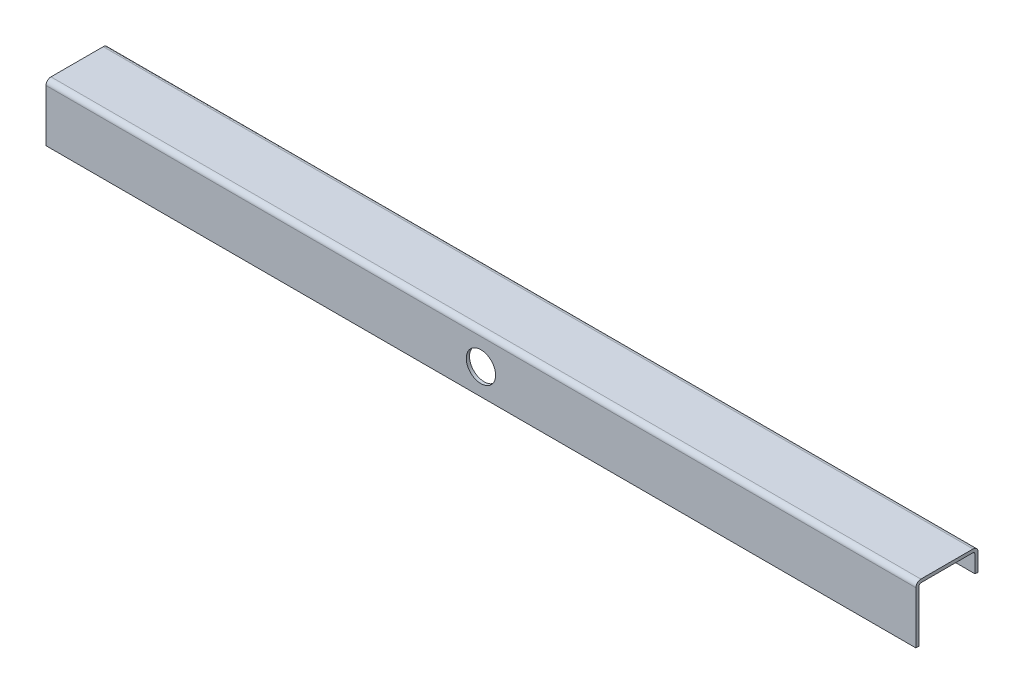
from build123d import *

# Parameters (mm, degrees)
BOSS_EXTRUDE1_DEPTH = 177.8
SCALE1_SCALE_X      = 1
SCALE1_SCALE_Y      = 0.4
SCALE1_SCALE_Z      = 0.4
SKETCH2_R           = 3
CUT_EXTRUDE1_DEPTH  = 181.312669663


with BuildPart() as part:
    # Sketch1 → Boss-Extrude1 (new body)
    with BuildSketch(Plane(origin=(0, 0, 0), x_dir=(0, 0, -1), z_dir=(1, 0, 0))):
        with BuildLine():
            Line((0, 19.984441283), (0, 29.21))
            ThreePointArc((0, 29.21), (-0.743948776, 31.006051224), (-2.54, 31.75))
            Line((-2.54, 31.75), (-29.21, 31.75))
            ThreePointArc((-29.21, 31.75), (-31.006051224, 31.006051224), (-31.75, 29.21))
            Line((-31.75, 29.21), (-31.75, 2.54))
            Line((-31.75, 2.54), (-30.099, 2.54))
            Line((-30.099, 2.54), (-30.099, 29.21))
            ThreePointArc((-30.099, 29.21), (-29.838617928, 29.838617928), (-29.21, 30.099))
            Line((-29.21, 30.099), (-2.54, 30.099))
            ThreePointArc((-2.54, 30.099), (-1.911382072, 29.838617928), (-1.651, 29.21))
            Line((-1.651, 29.21), (-1.651, 20.335372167))
            Line((-1.651, 20.335372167), (0, 19.984441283))
        make_face()
    extrude(amount=BOSS_EXTRUDE1_DEPTH)


with BuildPart() as part_1:
    # Scale1: scaled about (88.9, 24.126477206, 19.786725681)
    add(part.part.scale((SCALE1_SCALE_X, SCALE1_SCALE_Y, SCALE1_SCALE_Z), about=(88.9, 24.126477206, 19.786725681)))

    # Sketch2 → Cut-Extrude1 (cut, through all)
    with BuildSketch(Plane.XY.offset(24.572035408)):
        with Locations((88.9, 20.825886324)):
            Circle(SKETCH2_R)
    extrude(amount=-CUT_EXTRUDE1_DEPTH, mode=Mode.SUBTRACT)


solid = part_1.part
